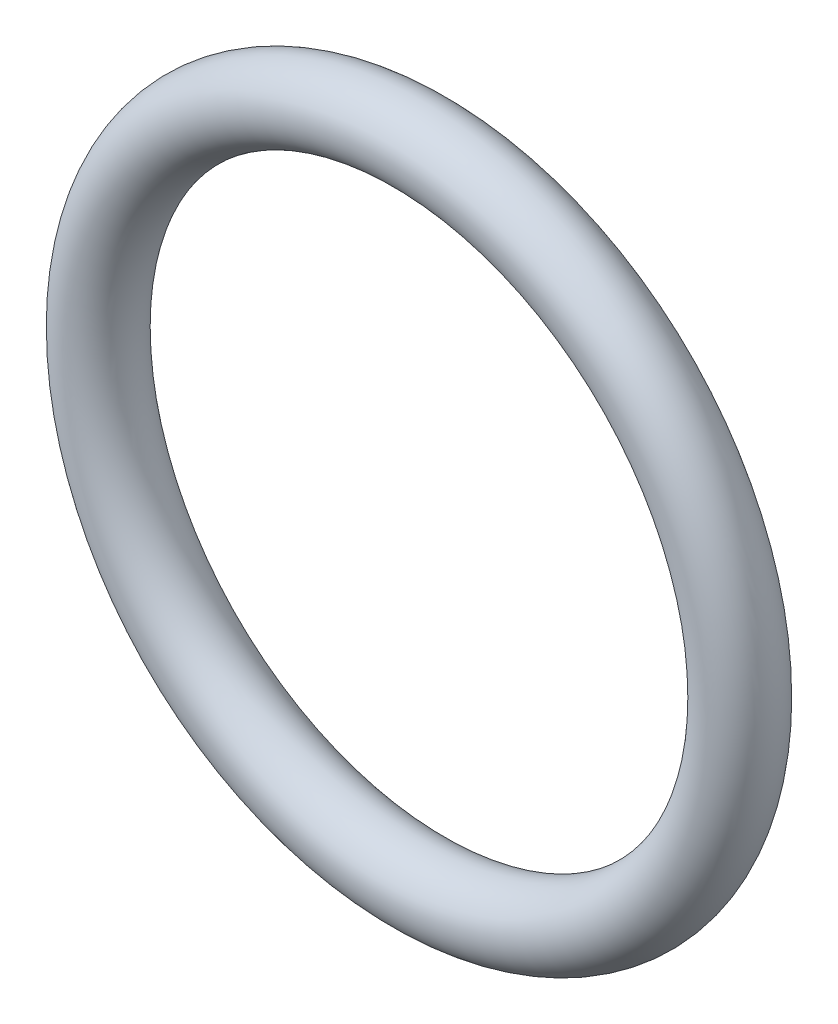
from build123d import *

# Parameters (mm, degrees)
ESQUISSE1_R = 2.6


with BuildPart() as part:
    # Esquisse1 → R_volution1 (revolve)
    with BuildSketch(Plane(origin=(0, 0, 0), x_dir=(0, 0, -1), z_dir=(1, 0, 0)), mode=Mode.PRIVATE) as r_volution1_sk:
        with Locations((0, 22.7)):
            Circle(ESQUISSE1_R)
    revolve(r_volution1_sk.sketch.rotate(Axis((0, 0, 36.41978022), (0, 0, -1)), 90), axis=Axis((0, 0, 36.41978022), (0, 0, -1)))


solid = part.part
